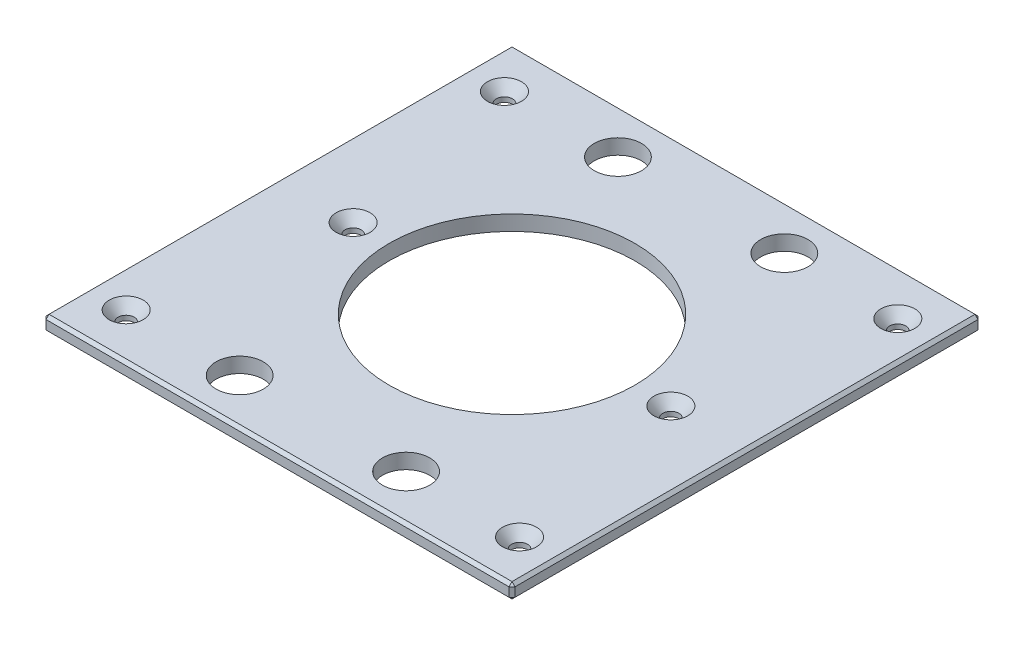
ISO-10303-21;
HEADER;
FILE_DESCRIPTION(('STEP AP214'),'2;1');
FILE_NAME('part.step','',(''),(''),'','','');
FILE_SCHEMA(('AUTOMOTIVE_DESIGN { 1 0 10303 214 1 1 1 1 }'));
ENDSEC;
DATA;
#1=APPLICATION_CONTEXT('core data for automotive mechanical design processes');
#2=APPLICATION_PROTOCOL_DEFINITION('international standard','automotive_design',2000,#1);
#3=PRODUCT_CONTEXT('',#1,'mechanical');
#4=PRODUCT('Part','Part','',(#3));
#5=PRODUCT_RELATED_PRODUCT_CATEGORY('part','',(#4));
#6=PRODUCT_DEFINITION_FORMATION('','',#4);
#7=PRODUCT_DEFINITION_CONTEXT('part definition',#1,'design');
#8=PRODUCT_DEFINITION('design','',#6,#7);
#9=PRODUCT_DEFINITION_SHAPE('','',#8);
#10=(LENGTH_UNIT() NAMED_UNIT(*) SI_UNIT(.MILLI.,.METRE.));
#11=(NAMED_UNIT(*) PLANE_ANGLE_UNIT() SI_UNIT($,.RADIAN.));
#12=(NAMED_UNIT(*) SI_UNIT($,.STERADIAN.) SOLID_ANGLE_UNIT());
#13=UNCERTAINTY_MEASURE_WITH_UNIT(LENGTH_MEASURE(1.E-05),#10,'distance_accuracy_value','');
#14=(GEOMETRIC_REPRESENTATION_CONTEXT(3) GLOBAL_UNCERTAINTY_ASSIGNED_CONTEXT((#13)) GLOBAL_UNIT_ASSIGNED_CONTEXT((#10,
#11,#12)) REPRESENTATION_CONTEXT('',''));
#15=CARTESIAN_POINT('',(0.,0.,0.));
#16=DIRECTION('',(0.,0.,1.));
#17=DIRECTION('',(1.,0.,0.));
#18=AXIS2_PLACEMENT_3D('',#15,#16,#17);
#19=CARTESIAN_POINT('',(-98.425,6.35,-98.425));
#20=DIRECTION('',(1.,0.,0.));
#21=DIRECTION('',(0.,0.,-1.));
#22=AXIS2_PLACEMENT_3D('',#19,#20,#21);
#23=PLANE('',#22);
#24=DIRECTION('',(0.,0.,-1.));
#25=VECTOR('',#24,1.);
#26=CARTESIAN_POINT('',(-98.425,5.08000000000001,-98.425));
#27=LINE('',#26,#25);
#28=CARTESIAN_POINT('',(-98.425,5.08000000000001,97.155));
#29=VERTEX_POINT('',#28);
#30=CARTESIAN_POINT('',(-98.425,5.08000000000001,-97.155));
#31=VERTEX_POINT('',#30);
#32=EDGE_CURVE('E134',#29,#31,#27,.T.);
#33=ORIENTED_EDGE('',*,*,#32,.T.);
#34=DIRECTION('',(0.,-1.,0.));
#35=VECTOR('',#34,1.);
#36=CARTESIAN_POINT('',(-98.425,6.35,-97.155));
#37=LINE('',#36,#35);
#38=CARTESIAN_POINT('',(-98.425,1.26999999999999,-97.155));
#39=VERTEX_POINT('',#38);
#40=EDGE_CURVE('E130',#31,#39,#37,.T.);
#41=ORIENTED_EDGE('',*,*,#40,.T.);
#42=DIRECTION('',(0.,0.,1.));
#43=VECTOR('',#42,1.);
#44=CARTESIAN_POINT('',(-98.425,1.26999999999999,-98.425));
#45=LINE('',#44,#43);
#46=CARTESIAN_POINT('',(-98.425,1.26999999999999,97.155));
#47=VERTEX_POINT('',#46);
#48=EDGE_CURVE('E125',#39,#47,#45,.T.);
#49=ORIENTED_EDGE('',*,*,#48,.T.);
#50=DIRECTION('',(0.,1.,0.));
#51=VECTOR('',#50,1.);
#52=CARTESIAN_POINT('',(-98.425,6.35,97.155));
#53=LINE('',#52,#51);
#54=EDGE_CURVE('E127',#47,#29,#53,.T.);
#55=ORIENTED_EDGE('',*,*,#54,.T.);
#56=EDGE_LOOP('',(#33,#41,#49,#55));
#57=FACE_BOUND('',#56,.T.);
#58=ADVANCED_FACE('F34',(#57),#23,.F.);
#59=CARTESIAN_POINT('',(-98.425,6.35,98.425));
#60=DIRECTION('',(0.,0.,-1.));
#61=DIRECTION('',(-1.,0.,0.));
#62=AXIS2_PLACEMENT_3D('',#59,#60,#61);
#63=PLANE('',#62);
#64=DIRECTION('',(1.,0.,0.));
#65=VECTOR('',#64,1.);
#66=CARTESIAN_POINT('',(-98.425,1.27000000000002,98.425));
#67=LINE('',#66,#65);
#68=CARTESIAN_POINT('',(-97.155,1.27000000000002,98.425));
#69=VERTEX_POINT('',#68);
#70=CARTESIAN_POINT('',(97.155,1.27000000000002,98.425));
#71=VERTEX_POINT('',#70);
#72=EDGE_CURVE('E57',#69,#71,#67,.T.);
#73=ORIENTED_EDGE('',*,*,#72,.T.);
#74=DIRECTION('',(0.,1.,0.));
#75=VECTOR('',#74,1.);
#76=CARTESIAN_POINT('',(97.155,6.35,98.425));
#77=LINE('',#76,#75);
#78=CARTESIAN_POINT('',(97.155,5.07999999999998,98.425));
#79=VERTEX_POINT('',#78);
#80=EDGE_CURVE('E11',#71,#79,#77,.T.);
#81=ORIENTED_EDGE('',*,*,#80,.T.);
#82=DIRECTION('',(-1.,0.,0.));
#83=VECTOR('',#82,1.);
#84=CARTESIAN_POINT('',(-98.425,5.07999999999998,98.425));
#85=LINE('',#84,#83);
#86=CARTESIAN_POINT('',(-97.155,5.07999999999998,98.425));
#87=VERTEX_POINT('',#86);
#88=EDGE_CURVE('E43',#79,#87,#85,.T.);
#89=ORIENTED_EDGE('',*,*,#88,.T.);
#90=DIRECTION('',(0.,-1.,0.));
#91=VECTOR('',#90,1.);
#92=CARTESIAN_POINT('',(-97.155,6.35,98.425));
#93=LINE('',#92,#91);
#94=EDGE_CURVE('E278',#87,#69,#93,.T.);
#95=ORIENTED_EDGE('',*,*,#94,.T.);
#96=EDGE_LOOP('',(#73,#81,#89,#95));
#97=FACE_BOUND('',#96,.T.);
#98=ADVANCED_FACE('F347',(#97),#63,.F.);
#99=CARTESIAN_POINT('',(98.425,6.35,-98.425));
#100=DIRECTION('',(-1.,0.,0.));
#101=DIRECTION('',(0.,0.,1.));
#102=AXIS2_PLACEMENT_3D('',#99,#100,#101);
#103=PLANE('',#102);
#104=DIRECTION('',(0.,0.,-1.));
#105=VECTOR('',#104,1.);
#106=CARTESIAN_POINT('',(98.425,1.27000000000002,-98.425));
#107=LINE('',#106,#105);
#108=CARTESIAN_POINT('',(98.425,1.27000000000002,97.155));
#109=VERTEX_POINT('',#108);
#110=CARTESIAN_POINT('',(98.425,1.27000000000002,-97.155));
#111=VERTEX_POINT('',#110);
#112=EDGE_CURVE('E273',#109,#111,#107,.T.);
#113=ORIENTED_EDGE('',*,*,#112,.T.);
#114=DIRECTION('',(0.,1.,0.));
#115=VECTOR('',#114,1.);
#116=CARTESIAN_POINT('',(98.425,6.35,-97.155));
#117=LINE('',#116,#115);
#118=CARTESIAN_POINT('',(98.425,5.08000000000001,-97.155));
#119=VERTEX_POINT('',#118);
#120=EDGE_CURVE('E275',#111,#119,#117,.T.);
#121=ORIENTED_EDGE('',*,*,#120,.T.);
#122=DIRECTION('',(0.,0.,1.));
#123=VECTOR('',#122,1.);
#124=CARTESIAN_POINT('',(98.425,5.08000000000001,98.425));
#125=LINE('',#124,#123);
#126=CARTESIAN_POINT('',(98.425,5.08000000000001,97.155));
#127=VERTEX_POINT('',#126);
#128=EDGE_CURVE('E271',#119,#127,#125,.T.);
#129=ORIENTED_EDGE('',*,*,#128,.T.);
#130=DIRECTION('',(0.,-1.,0.));
#131=VECTOR('',#130,1.);
#132=CARTESIAN_POINT('',(98.425,6.35,97.155));
#133=LINE('',#132,#131);
#134=EDGE_CURVE('E269',#127,#109,#133,.T.);
#135=ORIENTED_EDGE('',*,*,#134,.T.);
#136=EDGE_LOOP('',(#113,#121,#129,#135));
#137=FACE_BOUND('',#136,.T.);
#138=ADVANCED_FACE('F334',(#137),#103,.F.);
#139=CARTESIAN_POINT('',(-98.425,6.35,-98.425));
#140=DIRECTION('',(0.,0.,1.));
#141=DIRECTION('',(1.,0.,0.));
#142=AXIS2_PLACEMENT_3D('',#139,#140,#141);
#143=PLANE('',#142);
#144=DIRECTION('',(-1.,0.,0.));
#145=VECTOR('',#144,1.);
#146=CARTESIAN_POINT('',(-98.425,1.27000000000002,-98.425));
#147=LINE('',#146,#145);
#148=CARTESIAN_POINT('',(97.155,1.27000000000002,-98.425));
#149=VERTEX_POINT('',#148);
#150=CARTESIAN_POINT('',(-97.155,1.27000000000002,-98.425));
#151=VERTEX_POINT('',#150);
#152=EDGE_CURVE('E245',#149,#151,#147,.T.);
#153=ORIENTED_EDGE('',*,*,#152,.T.);
#154=DIRECTION('',(0.,1.,0.));
#155=VECTOR('',#154,1.);
#156=CARTESIAN_POINT('',(-97.155,6.35,-98.425));
#157=LINE('',#156,#155);
#158=CARTESIAN_POINT('',(-97.155,5.08000000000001,-98.425));
#159=VERTEX_POINT('',#158);
#160=EDGE_CURVE('E249',#151,#159,#157,.T.);
#161=ORIENTED_EDGE('',*,*,#160,.T.);
#162=DIRECTION('',(1.,0.,0.));
#163=VECTOR('',#162,1.);
#164=CARTESIAN_POINT('',(98.425,5.08000000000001,-98.425));
#165=LINE('',#164,#163);
#166=CARTESIAN_POINT('',(97.155,5.08000000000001,-98.425));
#167=VERTEX_POINT('',#166);
#168=EDGE_CURVE('E247',#159,#167,#165,.T.);
#169=ORIENTED_EDGE('',*,*,#168,.T.);
#170=DIRECTION('',(0.,-1.,0.));
#171=VECTOR('',#170,1.);
#172=CARTESIAN_POINT('',(97.155,6.35,-98.425));
#173=LINE('',#172,#171);
#174=EDGE_CURVE('E243',#167,#149,#173,.T.);
#175=ORIENTED_EDGE('',*,*,#174,.T.);
#176=EDGE_LOOP('',(#153,#161,#169,#175));
#177=FACE_BOUND('',#176,.T.);
#178=ADVANCED_FACE('F308',(#177),#143,.F.);
#179=CARTESIAN_POINT('',(0.,6.35,0.));
#180=DIRECTION('',(0.,1.,0.));
#181=DIRECTION('',(0.,0.,1.));
#182=AXIS2_PLACEMENT_3D('',#179,#180,#181);
#183=PLANE('',#182);
#184=CARTESIAN_POINT('',(82.55,6.35,-79.375));
#185=DIRECTION('',(0.,1.,0.));
#186=DIRECTION('',(0.,0.,1.));
#187=AXIS2_PLACEMENT_3D('',#184,#185,#186);
#188=CIRCLE('',#187,7.1374);
#189=CARTESIAN_POINT('',(82.55,6.35,-72.2376));
#190=VERTEX_POINT('',#189);
#191=EDGE_CURVE('E751',#190,#190,#188,.T.);
#192=ORIENTED_EDGE('',*,*,#191,.F.);
#193=EDGE_LOOP('',(#192));
#194=FACE_BOUND('',#193,.T.);
#195=CARTESIAN_POINT('',(82.55,6.35,79.375));
#196=DIRECTION('',(0.,1.,0.));
#197=DIRECTION('',(0.,0.,1.));
#198=AXIS2_PLACEMENT_3D('',#195,#196,#197);
#199=CIRCLE('',#198,7.1374);
#200=CARTESIAN_POINT('',(82.55,6.35,86.5124));
#201=VERTEX_POINT('',#200);
#202=EDGE_CURVE('E755',#201,#201,#199,.T.);
#203=ORIENTED_EDGE('',*,*,#202,.F.);
#204=EDGE_LOOP('',(#203));
#205=FACE_BOUND('',#204,.T.);
#206=CARTESIAN_POINT('',(-82.55,6.35,79.375));
#207=DIRECTION('',(0.,1.,0.));
#208=DIRECTION('',(0.,0.,1.));
#209=AXIS2_PLACEMENT_3D('',#206,#207,#208);
#210=CIRCLE('',#209,7.1374);
#211=CARTESIAN_POINT('',(-82.55,6.35,86.5124));
#212=VERTEX_POINT('',#211);
#213=EDGE_CURVE('E759',#212,#212,#210,.T.);
#214=ORIENTED_EDGE('',*,*,#213,.F.);
#215=EDGE_LOOP('',(#214));
#216=FACE_BOUND('',#215,.T.);
#217=CARTESIAN_POINT('',(-66.675,6.35,0.));
#218=DIRECTION('',(0.,1.,0.));
#219=DIRECTION('',(0.,0.,1.));
#220=AXIS2_PLACEMENT_3D('',#217,#218,#219);
#221=CIRCLE('',#220,7.1374);
#222=CARTESIAN_POINT('',(-66.675,6.35,7.1374));
#223=VERTEX_POINT('',#222);
#224=EDGE_CURVE('E763',#223,#223,#221,.T.);
#225=ORIENTED_EDGE('',*,*,#224,.F.);
#226=EDGE_LOOP('',(#225));
#227=FACE_BOUND('',#226,.T.);
#228=CARTESIAN_POINT('',(66.675,6.35,0.));
#229=DIRECTION('',(0.,1.,0.));
#230=DIRECTION('',(0.,0.,1.));
#231=AXIS2_PLACEMENT_3D('',#228,#229,#230);
#232=CIRCLE('',#231,7.1374);
#233=CARTESIAN_POINT('',(66.675,6.35,7.1374));
#234=VERTEX_POINT('',#233);
#235=EDGE_CURVE('E767',#234,#234,#232,.T.);
#236=ORIENTED_EDGE('',*,*,#235,.F.);
#237=EDGE_LOOP('',(#236));
#238=FACE_BOUND('',#237,.T.);
#239=CARTESIAN_POINT('',(-82.55,6.35,-79.375));
#240=DIRECTION('',(0.,1.,0.));
#241=DIRECTION('',(0.,0.,1.));
#242=AXIS2_PLACEMENT_3D('',#239,#240,#241);
#243=CIRCLE('',#242,7.1374);
#244=CARTESIAN_POINT('',(-82.55,6.35,-72.2376));
#245=VERTEX_POINT('',#244);
#246=EDGE_CURVE('E770',#245,#245,#243,.T.);
#247=ORIENTED_EDGE('',*,*,#246,.F.);
#248=EDGE_LOOP('',(#247));
#249=FACE_BOUND('',#248,.T.);
#250=DIRECTION('',(0.,0.,-1.));
#251=VECTOR('',#250,1.);
#252=CARTESIAN_POINT('',(97.155,6.35,-98.425));
#253=LINE('',#252,#251);
#254=CARTESIAN_POINT('',(97.155,6.35,97.155));
#255=VERTEX_POINT('',#254);
#256=CARTESIAN_POINT('',(97.155,6.35,-97.155));
#257=VERTEX_POINT('',#256);
#258=EDGE_CURVE('E256',#255,#257,#253,.T.);
#259=ORIENTED_EDGE('',*,*,#258,.T.);
#260=DIRECTION('',(-1.,0.,0.));
#261=VECTOR('',#260,1.);
#262=CARTESIAN_POINT('',(-98.425,6.35,-97.155));
#263=LINE('',#262,#261);
#264=CARTESIAN_POINT('',(-97.155,6.35,-97.155));
#265=VERTEX_POINT('',#264);
#266=EDGE_CURVE('E258',#257,#265,#263,.T.);
#267=ORIENTED_EDGE('',*,*,#266,.T.);
#268=DIRECTION('',(0.,0.,1.));
#269=VECTOR('',#268,1.);
#270=CARTESIAN_POINT('',(-97.155,6.35,98.425));
#271=LINE('',#270,#269);
#272=CARTESIAN_POINT('',(-97.155,6.35,97.155));
#273=VERTEX_POINT('',#272);
#274=EDGE_CURVE('E254',#265,#273,#271,.T.);
#275=ORIENTED_EDGE('',*,*,#274,.T.);
#276=DIRECTION('',(1.,0.,0.));
#277=VECTOR('',#276,1.);
#278=CARTESIAN_POINT('',(98.425,6.35,97.155));
#279=LINE('',#278,#277);
#280=EDGE_CURVE('E252',#273,#255,#279,.T.);
#281=ORIENTED_EDGE('',*,*,#280,.T.);
#282=EDGE_LOOP('',(#259,#267,#275,#281));
#283=FACE_BOUND('',#282,.T.);
#284=CARTESIAN_POINT('',(34.925,6.35,-79.375));
#285=DIRECTION('',(0.,1.,0.));
#286=DIRECTION('',(0.,0.,1.));
#287=AXIS2_PLACEMENT_3D('',#284,#285,#286);
#288=CIRCLE('',#287,9.921875);
#289=CARTESIAN_POINT('',(34.925,6.35,-69.453125));
#290=VERTEX_POINT('',#289);
#291=EDGE_CURVE('E203',#290,#290,#288,.T.);
#292=ORIENTED_EDGE('',*,*,#291,.F.);
#293=EDGE_LOOP('',(#292));
#294=FACE_BOUND('',#293,.T.);
#295=CARTESIAN_POINT('',(-34.925,6.35,-79.375));
#296=DIRECTION('',(0.,1.,0.));
#297=DIRECTION('',(0.,0.,1.));
#298=AXIS2_PLACEMENT_3D('',#295,#296,#297);
#299=CIRCLE('',#298,9.921875);
#300=CARTESIAN_POINT('',(-34.925,6.35,-69.453125));
#301=VERTEX_POINT('',#300);
#302=EDGE_CURVE('E213',#301,#301,#299,.T.);
#303=ORIENTED_EDGE('',*,*,#302,.F.);
#304=EDGE_LOOP('',(#303));
#305=FACE_BOUND('',#304,.T.);
#306=CARTESIAN_POINT('',(34.925,6.35,79.375));
#307=DIRECTION('',(0.,1.,0.));
#308=DIRECTION('',(0.,0.,1.));
#309=AXIS2_PLACEMENT_3D('',#306,#307,#308);
#310=CIRCLE('',#309,9.921875);
#311=CARTESIAN_POINT('',(34.925,6.35,89.296875));
#312=VERTEX_POINT('',#311);
#313=EDGE_CURVE('E224',#312,#312,#310,.T.);
#314=ORIENTED_EDGE('',*,*,#313,.F.);
#315=EDGE_LOOP('',(#314));
#316=FACE_BOUND('',#315,.T.);
#317=CARTESIAN_POINT('',(-34.925,6.35,79.375));
#318=DIRECTION('',(0.,1.,0.));
#319=DIRECTION('',(0.,0.,1.));
#320=AXIS2_PLACEMENT_3D('',#317,#318,#319);
#321=CIRCLE('',#320,9.921875);
#322=CARTESIAN_POINT('',(-34.925,6.35,89.296875));
#323=VERTEX_POINT('',#322);
#324=EDGE_CURVE('E230',#323,#323,#321,.T.);
#325=ORIENTED_EDGE('',*,*,#324,.F.);
#326=EDGE_LOOP('',(#325));
#327=FACE_BOUND('',#326,.T.);
#328=CARTESIAN_POINT('',(0.,6.35,0.));
#329=DIRECTION('',(0.,1.,0.));
#330=DIRECTION('',(0.,0.,1.));
#331=AXIS2_PLACEMENT_3D('',#328,#329,#330);
#332=CIRCLE('',#331,51.562);
#333=CARTESIAN_POINT('',(0.,6.35,51.562));
#334=VERTEX_POINT('',#333);
#335=EDGE_CURVE('E236',#334,#334,#332,.T.);
#336=ORIENTED_EDGE('',*,*,#335,.F.);
#337=EDGE_LOOP('',(#336));
#338=FACE_BOUND('',#337,.T.);
#339=ADVANCED_FACE('F356',(#194,#205,#216,#227,#238,#249,#283,#294,#305,#316,#327,#338),#183,.T.);
#340=CARTESIAN_POINT('',(0.,0.,0.));
#341=DIRECTION('',(0.,1.,0.));
#342=DIRECTION('',(0.,0.,1.));
#343=AXIS2_PLACEMENT_3D('',#340,#341,#342);
#344=PLANE('',#343);
#345=CARTESIAN_POINT('',(82.55,0.,-79.375));
#346=DIRECTION('',(0.,1.,0.));
#347=DIRECTION('',(0.,0.,1.));
#348=AXIS2_PLACEMENT_3D('',#345,#346,#347);
#349=CIRCLE('',#348,3.3782);
#350=CARTESIAN_POINT('',(82.55,0.,-75.9968));
#351=VERTEX_POINT('',#350);
#352=EDGE_CURVE('E804',#351,#351,#349,.T.);
#353=ORIENTED_EDGE('',*,*,#352,.T.);
#354=EDGE_LOOP('',(#353));
#355=FACE_BOUND('',#354,.T.);
#356=CARTESIAN_POINT('',(82.55,0.,79.375));
#357=DIRECTION('',(0.,1.,0.));
#358=DIRECTION('',(0.,0.,1.));
#359=AXIS2_PLACEMENT_3D('',#356,#357,#358);
#360=CIRCLE('',#359,3.3782);
#361=CARTESIAN_POINT('',(82.55,0.,82.7532));
#362=VERTEX_POINT('',#361);
#363=EDGE_CURVE('E797',#362,#362,#360,.T.);
#364=ORIENTED_EDGE('',*,*,#363,.T.);
#365=EDGE_LOOP('',(#364));
#366=FACE_BOUND('',#365,.T.);
#367=CARTESIAN_POINT('',(-82.55,0.,79.375));
#368=DIRECTION('',(0.,1.,0.));
#369=DIRECTION('',(0.,0.,1.));
#370=AXIS2_PLACEMENT_3D('',#367,#368,#369);
#371=CIRCLE('',#370,3.3782);
#372=CARTESIAN_POINT('',(-82.55,0.,82.7532));
#373=VERTEX_POINT('',#372);
#374=EDGE_CURVE('E790',#373,#373,#371,.T.);
#375=ORIENTED_EDGE('',*,*,#374,.T.);
#376=EDGE_LOOP('',(#375));
#377=FACE_BOUND('',#376,.T.);
#378=CARTESIAN_POINT('',(-66.675,0.,0.));
#379=DIRECTION('',(0.,1.,0.));
#380=DIRECTION('',(0.,0.,1.));
#381=AXIS2_PLACEMENT_3D('',#378,#379,#380);
#382=CIRCLE('',#381,3.3782);
#383=CARTESIAN_POINT('',(-66.675,0.,3.3782));
#384=VERTEX_POINT('',#383);
#385=EDGE_CURVE('E783',#384,#384,#382,.T.);
#386=ORIENTED_EDGE('',*,*,#385,.T.);
#387=EDGE_LOOP('',(#386));
#388=FACE_BOUND('',#387,.T.);
#389=CARTESIAN_POINT('',(66.675,0.,0.));
#390=DIRECTION('',(0.,1.,0.));
#391=DIRECTION('',(0.,0.,1.));
#392=AXIS2_PLACEMENT_3D('',#389,#390,#391);
#393=CIRCLE('',#392,3.3782);
#394=CARTESIAN_POINT('',(66.675,0.,3.3782));
#395=VERTEX_POINT('',#394);
#396=EDGE_CURVE('E773',#395,#395,#393,.T.);
#397=ORIENTED_EDGE('',*,*,#396,.T.);
#398=EDGE_LOOP('',(#397));
#399=FACE_BOUND('',#398,.T.);
#400=CARTESIAN_POINT('',(-82.55,0.,-79.375));
#401=DIRECTION('',(0.,1.,0.));
#402=DIRECTION('',(0.,0.,1.));
#403=AXIS2_PLACEMENT_3D('',#400,#401,#402);
#404=CIRCLE('',#403,3.3782);
#405=CARTESIAN_POINT('',(-82.55,0.,-75.9968));
#406=VERTEX_POINT('',#405);
#407=EDGE_CURVE('E216',#406,#406,#404,.T.);
#408=ORIENTED_EDGE('',*,*,#407,.T.);
#409=EDGE_LOOP('',(#408));
#410=FACE_BOUND('',#409,.T.);
#411=DIRECTION('',(0.,0.,-1.));
#412=VECTOR('',#411,1.);
#413=CARTESIAN_POINT('',(-97.155,0.,0.));
#414=LINE('',#413,#412);
#415=CARTESIAN_POINT('',(-97.155,0.,97.155));
#416=VERTEX_POINT('',#415);
#417=CARTESIAN_POINT('',(-97.155,0.,-97.155));
#418=VERTEX_POINT('',#417);
#419=EDGE_CURVE('E157',#416,#418,#414,.T.);
#420=ORIENTED_EDGE('',*,*,#419,.T.);
#421=DIRECTION('',(1.,0.,0.));
#422=VECTOR('',#421,1.);
#423=CARTESIAN_POINT('',(0.,0.,-97.155));
#424=LINE('',#423,#422);
#425=CARTESIAN_POINT('',(97.155,0.,-97.155));
#426=VERTEX_POINT('',#425);
#427=EDGE_CURVE('E266',#418,#426,#424,.T.);
#428=ORIENTED_EDGE('',*,*,#427,.T.);
#429=DIRECTION('',(0.,0.,1.));
#430=VECTOR('',#429,1.);
#431=CARTESIAN_POINT('',(97.155,0.,0.));
#432=LINE('',#431,#430);
#433=CARTESIAN_POINT('',(97.155,0.,97.155));
#434=VERTEX_POINT('',#433);
#435=EDGE_CURVE('E264',#426,#434,#432,.T.);
#436=ORIENTED_EDGE('',*,*,#435,.T.);
#437=DIRECTION('',(-1.,0.,0.));
#438=VECTOR('',#437,1.);
#439=CARTESIAN_POINT('',(0.,0.,97.155));
#440=LINE('',#439,#438);
#441=EDGE_CURVE('E261',#434,#416,#440,.T.);
#442=ORIENTED_EDGE('',*,*,#441,.T.);
#443=EDGE_LOOP('',(#420,#428,#436,#442));
#444=FACE_BOUND('',#443,.T.);
#445=CARTESIAN_POINT('',(34.925,0.,-79.375));
#446=DIRECTION('',(0.,1.,0.));
#447=DIRECTION('',(0.,0.,1.));
#448=AXIS2_PLACEMENT_3D('',#445,#446,#447);
#449=CIRCLE('',#448,9.921875);
#450=CARTESIAN_POINT('',(34.925,0.,-69.453125));
#451=VERTEX_POINT('',#450);
#452=EDGE_CURVE('E208',#451,#451,#449,.T.);
#453=ORIENTED_EDGE('',*,*,#452,.T.);
#454=EDGE_LOOP('',(#453));
#455=FACE_BOUND('',#454,.T.);
#456=CARTESIAN_POINT('',(-34.925,0.,-79.375));
#457=DIRECTION('',(0.,1.,0.));
#458=DIRECTION('',(0.,0.,1.));
#459=AXIS2_PLACEMENT_3D('',#456,#457,#458);
#460=CIRCLE('',#459,9.921875);
#461=CARTESIAN_POINT('',(-34.925,0.,-69.453125));
#462=VERTEX_POINT('',#461);
#463=EDGE_CURVE('E221',#462,#462,#460,.T.);
#464=ORIENTED_EDGE('',*,*,#463,.T.);
#465=EDGE_LOOP('',(#464));
#466=FACE_BOUND('',#465,.T.);
#467=CARTESIAN_POINT('',(34.925,0.,79.375));
#468=DIRECTION('',(0.,1.,0.));
#469=DIRECTION('',(0.,0.,1.));
#470=AXIS2_PLACEMENT_3D('',#467,#468,#469);
#471=CIRCLE('',#470,9.921875);
#472=CARTESIAN_POINT('',(34.925,0.,89.296875));
#473=VERTEX_POINT('',#472);
#474=EDGE_CURVE('E227',#473,#473,#471,.T.);
#475=ORIENTED_EDGE('',*,*,#474,.T.);
#476=EDGE_LOOP('',(#475));
#477=FACE_BOUND('',#476,.T.);
#478=CARTESIAN_POINT('',(-34.925,0.,79.375));
#479=DIRECTION('',(0.,1.,0.));
#480=DIRECTION('',(0.,0.,1.));
#481=AXIS2_PLACEMENT_3D('',#478,#479,#480);
#482=CIRCLE('',#481,9.921875);
#483=CARTESIAN_POINT('',(-34.925,0.,89.296875));
#484=VERTEX_POINT('',#483);
#485=EDGE_CURVE('E233',#484,#484,#482,.T.);
#486=ORIENTED_EDGE('',*,*,#485,.T.);
#487=EDGE_LOOP('',(#486));
#488=FACE_BOUND('',#487,.T.);
#489=CARTESIAN_POINT('',(0.,0.,0.));
#490=DIRECTION('',(0.,1.,0.));
#491=DIRECTION('',(0.,0.,1.));
#492=AXIS2_PLACEMENT_3D('',#489,#490,#491);
#493=CIRCLE('',#492,51.562);
#494=CARTESIAN_POINT('',(0.,0.,51.562));
#495=VERTEX_POINT('',#494);
#496=EDGE_CURVE('E146',#495,#495,#493,.T.);
#497=ORIENTED_EDGE('',*,*,#496,.T.);
#498=EDGE_LOOP('',(#497));
#499=FACE_BOUND('',#498,.T.);
#500=ADVANCED_FACE('F321',(#355,#366,#377,#388,#399,#410,#444,#455,#466,#477,#488,#499),#344,.F.);
#501=CARTESIAN_POINT('',(0.,0.,0.));
#502=DIRECTION('',(0.,1.,0.));
#503=DIRECTION('',(0.,0.,1.));
#504=AXIS2_PLACEMENT_3D('',#501,#502,#503);
#505=CYLINDRICAL_SURFACE('',#504,51.562);
#506=ORIENTED_EDGE('',*,*,#496,.F.);
#507=EDGE_LOOP('',(#506));
#508=FACE_BOUND('',#507,.T.);
#509=ORIENTED_EDGE('',*,*,#335,.T.);
#510=EDGE_LOOP('',(#509));
#511=FACE_BOUND('',#510,.T.);
#512=ADVANCED_FACE('F690',(#508,#511),#505,.F.);
#513=CARTESIAN_POINT('',(-34.925,6.35,79.375));
#514=DIRECTION('',(0.,1.,0.));
#515=DIRECTION('',(0.,0.,1.));
#516=AXIS2_PLACEMENT_3D('',#513,#514,#515);
#517=CYLINDRICAL_SURFACE('',#516,9.921875);
#518=ORIENTED_EDGE('',*,*,#485,.F.);
#519=EDGE_LOOP('',(#518));
#520=FACE_BOUND('',#519,.T.);
#521=ORIENTED_EDGE('',*,*,#324,.T.);
#522=EDGE_LOOP('',(#521));
#523=FACE_BOUND('',#522,.T.);
#524=ADVANCED_FACE('F681',(#520,#523),#517,.F.);
#525=CARTESIAN_POINT('',(34.925,6.35,79.375));
#526=DIRECTION('',(0.,1.,0.));
#527=DIRECTION('',(0.,0.,1.));
#528=AXIS2_PLACEMENT_3D('',#525,#526,#527);
#529=CYLINDRICAL_SURFACE('',#528,9.921875);
#530=ORIENTED_EDGE('',*,*,#474,.F.);
#531=EDGE_LOOP('',(#530));
#532=FACE_BOUND('',#531,.T.);
#533=ORIENTED_EDGE('',*,*,#313,.T.);
#534=EDGE_LOOP('',(#533));
#535=FACE_BOUND('',#534,.T.);
#536=ADVANCED_FACE('F672',(#532,#535),#529,.F.);
#537=CARTESIAN_POINT('',(-34.925,6.35,-79.375));
#538=DIRECTION('',(0.,1.,0.));
#539=DIRECTION('',(0.,0.,1.));
#540=AXIS2_PLACEMENT_3D('',#537,#538,#539);
#541=CYLINDRICAL_SURFACE('',#540,9.921875);
#542=ORIENTED_EDGE('',*,*,#463,.F.);
#543=EDGE_LOOP('',(#542));
#544=FACE_BOUND('',#543,.T.);
#545=ORIENTED_EDGE('',*,*,#302,.T.);
#546=EDGE_LOOP('',(#545));
#547=FACE_BOUND('',#546,.T.);
#548=ADVANCED_FACE('F662',(#544,#547),#541,.F.);
#549=CARTESIAN_POINT('',(34.925,6.35,-79.375));
#550=DIRECTION('',(0.,1.,0.));
#551=DIRECTION('',(0.,0.,1.));
#552=AXIS2_PLACEMENT_3D('',#549,#550,#551);
#553=CYLINDRICAL_SURFACE('',#552,9.921875);
#554=ORIENTED_EDGE('',*,*,#452,.F.);
#555=EDGE_LOOP('',(#554));
#556=FACE_BOUND('',#555,.T.);
#557=ORIENTED_EDGE('',*,*,#291,.T.);
#558=EDGE_LOOP('',(#557));
#559=FACE_BOUND('',#558,.T.);
#560=ADVANCED_FACE('F365',(#556,#559),#553,.F.);
#561=CARTESIAN_POINT('',(98.425,6.35,97.155));
#562=DIRECTION('',(-0.70710678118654,0.,-0.707106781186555));
#563=DIRECTION('',(0.,-1.,0.));
#564=AXIS2_PLACEMENT_3D('',#561,#562,#563);
#565=PLANE('',#564);
#566=DIRECTION('',(-0.707106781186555,0.,0.70710678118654));
#567=VECTOR('',#566,1.);
#568=CARTESIAN_POINT('',(98.425,5.08000000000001,97.155));
#569=LINE('',#568,#567);
#570=EDGE_CURVE('E38',#79,#127,#569,.F.);
#571=ORIENTED_EDGE('',*,*,#570,.F.);
#572=ORIENTED_EDGE('',*,*,#80,.F.);
#573=DIRECTION('',(0.707106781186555,0.,-0.70710678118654));
#574=VECTOR('',#573,1.);
#575=CARTESIAN_POINT('',(97.79,1.27000000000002,97.79));
#576=LINE('',#575,#574);
#577=EDGE_CURVE('E196',#109,#71,#576,.F.);
#578=ORIENTED_EDGE('',*,*,#577,.F.);
#579=ORIENTED_EDGE('',*,*,#134,.F.);
#580=EDGE_LOOP('',(#571,#572,#578,#579));
#581=FACE_BOUND('',#580,.T.);
#582=ADVANCED_FACE('F36',(#581),#565,.F.);
#583=CARTESIAN_POINT('',(98.425,5.08000000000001,97.155));
#584=DIRECTION('',(0.577350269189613,0.577350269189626,0.577350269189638));
#585=DIRECTION('',(0.,-0.707106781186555,0.70710678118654));
#586=AXIS2_PLACEMENT_3D('',#583,#584,#585);
#587=PLANE('',#586);
#588=DIRECTION('',(0.,-0.707106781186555,0.70710678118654));
#589=VECTOR('',#588,1.);
#590=CARTESIAN_POINT('',(97.155,5.71499999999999,97.79));
#591=LINE('',#590,#589);
#592=EDGE_CURVE('E192',#79,#255,#591,.F.);
#593=ORIENTED_EDGE('',*,*,#592,.F.);
#594=ORIENTED_EDGE('',*,*,#570,.T.);
#595=DIRECTION('',(-0.707106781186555,0.70710678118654,0.));
#596=VECTOR('',#595,1.);
#597=CARTESIAN_POINT('',(98.425,5.08000000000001,97.155));
#598=LINE('',#597,#596);
#599=EDGE_CURVE('E194',#255,#127,#598,.F.);
#600=ORIENTED_EDGE('',*,*,#599,.F.);
#601=EDGE_LOOP('',(#593,#594,#600));
#602=FACE_BOUND('',#601,.T.);
#603=ADVANCED_FACE('F358',(#602),#587,.T.);
#604=CARTESIAN_POINT('',(97.155,0.,97.155));
#605=DIRECTION('',(0.577350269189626,-0.577350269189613,0.577350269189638));
#606=DIRECTION('',(0.707106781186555,0.,-0.70710678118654));
#607=AXIS2_PLACEMENT_3D('',#604,#605,#606);
#608=PLANE('',#607);
#609=DIRECTION('',(-0.70710678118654,-0.707106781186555,0.));
#610=VECTOR('',#609,1.);
#611=CARTESIAN_POINT('',(97.155,0.,97.155));
#612=LINE('',#611,#610);
#613=EDGE_CURVE('E186',#109,#434,#612,.T.);
#614=ORIENTED_EDGE('',*,*,#613,.F.);
#615=ORIENTED_EDGE('',*,*,#577,.T.);
#616=DIRECTION('',(0.,0.707106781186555,0.70710678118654));
#617=VECTOR('',#616,1.);
#618=CARTESIAN_POINT('',(97.155,0.,97.155));
#619=LINE('',#618,#617);
#620=EDGE_CURVE('E189',#434,#71,#619,.T.);
#621=ORIENTED_EDGE('',*,*,#620,.F.);
#622=EDGE_LOOP('',(#614,#615,#621));
#623=FACE_BOUND('',#622,.T.);
#624=ADVANCED_FACE('F327',(#623),#608,.T.);
#625=CARTESIAN_POINT('',(97.155,6.35,0.));
#626=DIRECTION('',(0.70710678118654,0.707106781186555,0.));
#627=DIRECTION('',(0.,0.,1.));
#628=AXIS2_PLACEMENT_3D('',#625,#626,#627);
#629=PLANE('',#628);
#630=ORIENTED_EDGE('',*,*,#599,.T.);
#631=ORIENTED_EDGE('',*,*,#128,.F.);
#632=DIRECTION('',(0.707106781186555,-0.70710678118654,0.));
#633=VECTOR('',#632,1.);
#634=CARTESIAN_POINT('',(97.79,5.715,-97.155));
#635=LINE('',#634,#633);
#636=EDGE_CURVE('E181',#257,#119,#635,.T.);
#637=ORIENTED_EDGE('',*,*,#636,.F.);
#638=ORIENTED_EDGE('',*,*,#258,.F.);
#639=EDGE_LOOP('',(#630,#631,#637,#638));
#640=FACE_BOUND('',#639,.T.);
#641=ADVANCED_FACE('F344',(#640),#629,.T.);
#642=CARTESIAN_POINT('',(0.,6.35,97.155));
#643=DIRECTION('',(0.,0.70710678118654,0.707106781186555));
#644=DIRECTION('',(-1.,0.,0.));
#645=AXIS2_PLACEMENT_3D('',#642,#643,#644);
#646=PLANE('',#645);
#647=ORIENTED_EDGE('',*,*,#592,.T.);
#648=ORIENTED_EDGE('',*,*,#280,.F.);
#649=DIRECTION('',(0.,0.707106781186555,-0.70710678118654));
#650=VECTOR('',#649,1.);
#651=CARTESIAN_POINT('',(-97.155,6.35,97.155));
#652=LINE('',#651,#650);
#653=EDGE_CURVE('E178',#87,#273,#652,.T.);
#654=ORIENTED_EDGE('',*,*,#653,.F.);
#655=ORIENTED_EDGE('',*,*,#88,.F.);
#656=EDGE_LOOP('',(#647,#648,#654,#655));
#657=FACE_BOUND('',#656,.T.);
#658=ADVANCED_FACE('F349',(#657),#646,.T.);
#659=CARTESIAN_POINT('',(-97.155,6.35,98.425));
#660=DIRECTION('',(0.70710678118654,0.,-0.707106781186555));
#661=DIRECTION('',(0.,-1.,0.));
#662=AXIS2_PLACEMENT_3D('',#659,#660,#661);
#663=PLANE('',#662);
#664=DIRECTION('',(0.707106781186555,0.,0.70710678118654));
#665=VECTOR('',#664,1.);
#666=CARTESIAN_POINT('',(-98.425,1.26999999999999,97.155));
#667=LINE('',#666,#665);
#668=EDGE_CURVE('E141',#69,#47,#667,.F.);
#669=ORIENTED_EDGE('',*,*,#668,.F.);
#670=ORIENTED_EDGE('',*,*,#94,.F.);
#671=DIRECTION('',(-0.707106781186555,0.,-0.70710678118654));
#672=VECTOR('',#671,1.);
#673=CARTESIAN_POINT('',(-97.79,5.07999999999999,97.79));
#674=LINE('',#673,#672);
#675=EDGE_CURVE('E144',#29,#87,#674,.F.);
#676=ORIENTED_EDGE('',*,*,#675,.F.);
#677=ORIENTED_EDGE('',*,*,#54,.F.);
#678=EDGE_LOOP('',(#669,#670,#676,#677));
#679=FACE_BOUND('',#678,.T.);
#680=ADVANCED_FACE('F139',(#679),#663,.F.);
#681=CARTESIAN_POINT('',(-98.425,1.27000000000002,98.425));
#682=DIRECTION('',(0.,0.70710678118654,-0.707106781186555));
#683=DIRECTION('',(1.,0.,0.));
#684=AXIS2_PLACEMENT_3D('',#681,#682,#683);
#685=PLANE('',#684);
#686=ORIENTED_EDGE('',*,*,#620,.T.);
#687=ORIENTED_EDGE('',*,*,#72,.F.);
#688=DIRECTION('',(0.,-0.707106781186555,-0.70710678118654));
#689=VECTOR('',#688,1.);
#690=CARTESIAN_POINT('',(-97.155,0.635000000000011,97.79));
#691=LINE('',#690,#689);
#692=EDGE_CURVE('E154',#416,#69,#691,.F.);
#693=ORIENTED_EDGE('',*,*,#692,.F.);
#694=ORIENTED_EDGE('',*,*,#441,.F.);
#695=EDGE_LOOP('',(#686,#687,#693,#694));
#696=FACE_BOUND('',#695,.T.);
#697=ADVANCED_FACE('F326',(#696),#685,.F.);
#698=CARTESIAN_POINT('',(98.425,1.27000000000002,-98.425));
#699=DIRECTION('',(-0.707106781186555,0.70710678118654,0.));
#700=DIRECTION('',(0.,0.,-1.));
#701=AXIS2_PLACEMENT_3D('',#698,#699,#700);
#702=PLANE('',#701);
#703=ORIENTED_EDGE('',*,*,#613,.T.);
#704=ORIENTED_EDGE('',*,*,#435,.F.);
#705=DIRECTION('',(0.70710678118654,0.707106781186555,0.));
#706=VECTOR('',#705,1.);
#707=CARTESIAN_POINT('',(97.155,0.,-97.155));
#708=LINE('',#707,#706);
#709=EDGE_CURVE('E173',#111,#426,#708,.F.);
#710=ORIENTED_EDGE('',*,*,#709,.F.);
#711=ORIENTED_EDGE('',*,*,#112,.F.);
#712=EDGE_LOOP('',(#703,#704,#710,#711));
#713=FACE_BOUND('',#712,.T.);
#714=ADVANCED_FACE('F331',(#713),#702,.F.);
#715=CARTESIAN_POINT('',(97.155,6.35,-98.425));
#716=DIRECTION('',(-0.70710678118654,0.,0.707106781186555));
#717=DIRECTION('',(0.,-1.,0.));
#718=AXIS2_PLACEMENT_3D('',#715,#716,#717);
#719=PLANE('',#718);
#720=DIRECTION('',(0.707106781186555,0.,0.70710678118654));
#721=VECTOR('',#720,1.);
#722=CARTESIAN_POINT('',(97.155,5.08000000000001,-98.425));
#723=LINE('',#722,#721);
#724=EDGE_CURVE('E183',#119,#167,#723,.F.);
#725=ORIENTED_EDGE('',*,*,#724,.F.);
#726=ORIENTED_EDGE('',*,*,#120,.F.);
#727=DIRECTION('',(-0.707106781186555,0.,-0.70710678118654));
#728=VECTOR('',#727,1.);
#729=CARTESIAN_POINT('',(97.79,1.27000000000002,-97.79));
#730=LINE('',#729,#728);
#731=EDGE_CURVE('E170',#149,#111,#730,.F.);
#732=ORIENTED_EDGE('',*,*,#731,.F.);
#733=ORIENTED_EDGE('',*,*,#174,.F.);
#734=EDGE_LOOP('',(#725,#726,#732,#733));
#735=FACE_BOUND('',#734,.T.);
#736=ADVANCED_FACE('F339',(#735),#719,.F.);
#737=CARTESIAN_POINT('',(97.155,5.08000000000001,-98.425));
#738=DIRECTION('',(0.577350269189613,0.577350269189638,-0.577350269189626));
#739=DIRECTION('',(0.,0.70710678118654,0.707106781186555));
#740=AXIS2_PLACEMENT_3D('',#737,#738,#739);
#741=PLANE('',#740);
#742=ORIENTED_EDGE('',*,*,#636,.T.);
#743=ORIENTED_EDGE('',*,*,#724,.T.);
#744=DIRECTION('',(0.,0.70710678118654,0.707106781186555));
#745=VECTOR('',#744,1.);
#746=CARTESIAN_POINT('',(97.155,5.08000000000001,-98.425));
#747=LINE('',#746,#745);
#748=EDGE_CURVE('E162',#257,#167,#747,.F.);
#749=ORIENTED_EDGE('',*,*,#748,.F.);
#750=EDGE_LOOP('',(#742,#743,#749));
#751=FACE_BOUND('',#750,.T.);
#752=ADVANCED_FACE('F397',(#751),#741,.T.);
#753=CARTESIAN_POINT('',(-97.155,6.35,97.155));
#754=DIRECTION('',(-0.577350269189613,0.577350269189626,0.577350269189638));
#755=DIRECTION('',(0.,-0.707106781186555,0.70710678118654));
#756=AXIS2_PLACEMENT_3D('',#753,#754,#755);
#757=PLANE('',#756);
#758=ORIENTED_EDGE('',*,*,#675,.T.);
#759=ORIENTED_EDGE('',*,*,#653,.T.);
#760=DIRECTION('',(-0.707106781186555,-0.70710678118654,0.));
#761=VECTOR('',#760,1.);
#762=CARTESIAN_POINT('',(-97.155,6.35,97.155));
#763=LINE('',#762,#761);
#764=EDGE_CURVE('E158',#29,#273,#763,.F.);
#765=ORIENTED_EDGE('',*,*,#764,.F.);
#766=EDGE_LOOP('',(#758,#759,#765));
#767=FACE_BOUND('',#766,.T.);
#768=ADVANCED_FACE('F351',(#767),#757,.T.);
#769=CARTESIAN_POINT('',(-98.425,1.26999999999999,97.155));
#770=DIRECTION('',(-0.577350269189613,-0.577350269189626,0.577350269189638));
#771=DIRECTION('',(0.,-0.707106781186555,-0.70710678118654));
#772=AXIS2_PLACEMENT_3D('',#769,#770,#771);
#773=PLANE('',#772);
#774=ORIENTED_EDGE('',*,*,#692,.T.);
#775=ORIENTED_EDGE('',*,*,#668,.T.);
#776=DIRECTION('',(-0.707106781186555,0.70710678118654,0.));
#777=VECTOR('',#776,1.);
#778=CARTESIAN_POINT('',(-98.425,1.26999999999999,97.155));
#779=LINE('',#778,#777);
#780=EDGE_CURVE('E151',#416,#47,#779,.T.);
#781=ORIENTED_EDGE('',*,*,#780,.F.);
#782=EDGE_LOOP('',(#774,#775,#781));
#783=FACE_BOUND('',#782,.T.);
#784=ADVANCED_FACE('F150',(#783),#773,.T.);
#785=CARTESIAN_POINT('',(97.155,0.,-97.155));
#786=DIRECTION('',(0.577350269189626,-0.577350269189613,-0.577350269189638));
#787=DIRECTION('',(-0.707106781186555,0.,-0.70710678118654));
#788=AXIS2_PLACEMENT_3D('',#785,#786,#787);
#789=PLANE('',#788);
#790=ORIENTED_EDGE('',*,*,#731,.T.);
#791=ORIENTED_EDGE('',*,*,#709,.T.);
#792=DIRECTION('',(0.,-0.707106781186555,0.70710678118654));
#793=VECTOR('',#792,1.);
#794=CARTESIAN_POINT('',(97.155,0.,-97.155));
#795=LINE('',#794,#793);
#796=EDGE_CURVE('E159',#149,#426,#795,.T.);
#797=ORIENTED_EDGE('',*,*,#796,.F.);
#798=EDGE_LOOP('',(#790,#791,#797));
#799=FACE_BOUND('',#798,.T.);
#800=ADVANCED_FACE('F389',(#799),#789,.T.);
#801=CARTESIAN_POINT('',(0.,6.35,-97.155));
#802=DIRECTION('',(0.,0.707106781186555,-0.70710678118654));
#803=DIRECTION('',(1.,0.,0.));
#804=AXIS2_PLACEMENT_3D('',#801,#802,#803);
#805=PLANE('',#804);
#806=ORIENTED_EDGE('',*,*,#748,.T.);
#807=ORIENTED_EDGE('',*,*,#168,.F.);
#808=DIRECTION('',(0.,-0.70710678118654,-0.707106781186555));
#809=VECTOR('',#808,1.);
#810=CARTESIAN_POINT('',(-97.155,5.08000000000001,-98.425));
#811=LINE('',#810,#809);
#812=EDGE_CURVE('E164',#265,#159,#811,.T.);
#813=ORIENTED_EDGE('',*,*,#812,.F.);
#814=ORIENTED_EDGE('',*,*,#266,.F.);
#815=EDGE_LOOP('',(#806,#807,#813,#814));
#816=FACE_BOUND('',#815,.T.);
#817=ADVANCED_FACE('F303',(#816),#805,.T.);
#818=CARTESIAN_POINT('',(-97.155,6.35,0.));
#819=DIRECTION('',(-0.70710678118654,0.707106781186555,0.));
#820=DIRECTION('',(0.,0.,-1.));
#821=AXIS2_PLACEMENT_3D('',#818,#819,#820);
#822=PLANE('',#821);
#823=ORIENTED_EDGE('',*,*,#764,.T.);
#824=ORIENTED_EDGE('',*,*,#274,.F.);
#825=DIRECTION('',(0.707106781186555,0.70710678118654,0.));
#826=VECTOR('',#825,1.);
#827=CARTESIAN_POINT('',(-97.79,5.715,-97.155));
#828=LINE('',#827,#826);
#829=EDGE_CURVE('E292',#31,#265,#828,.T.);
#830=ORIENTED_EDGE('',*,*,#829,.F.);
#831=ORIENTED_EDGE('',*,*,#32,.F.);
#832=EDGE_LOOP('',(#823,#824,#830,#831));
#833=FACE_BOUND('',#832,.T.);
#834=ADVANCED_FACE('F354',(#833),#822,.T.);
#835=CARTESIAN_POINT('',(-98.425,1.26999999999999,-98.425));
#836=DIRECTION('',(0.70710678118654,0.707106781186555,0.));
#837=DIRECTION('',(0.,0.,1.));
#838=AXIS2_PLACEMENT_3D('',#835,#836,#837);
#839=PLANE('',#838);
#840=ORIENTED_EDGE('',*,*,#780,.T.);
#841=ORIENTED_EDGE('',*,*,#48,.F.);
#842=DIRECTION('',(0.707106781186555,-0.70710678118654,0.));
#843=VECTOR('',#842,1.);
#844=CARTESIAN_POINT('',(-98.425,1.26999999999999,-97.155));
#845=LINE('',#844,#843);
#846=EDGE_CURVE('E289',#418,#39,#845,.F.);
#847=ORIENTED_EDGE('',*,*,#846,.F.);
#848=ORIENTED_EDGE('',*,*,#419,.F.);
#849=EDGE_LOOP('',(#840,#841,#847,#848));
#850=FACE_BOUND('',#849,.T.);
#851=ADVANCED_FACE('F156',(#850),#839,.F.);
#852=CARTESIAN_POINT('',(-98.425,1.27000000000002,-98.425));
#853=DIRECTION('',(0.,0.70710678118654,0.707106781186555));
#854=DIRECTION('',(-1.,0.,0.));
#855=AXIS2_PLACEMENT_3D('',#852,#853,#854);
#856=PLANE('',#855);
#857=ORIENTED_EDGE('',*,*,#796,.T.);
#858=ORIENTED_EDGE('',*,*,#427,.F.);
#859=DIRECTION('',(0.,0.707106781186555,-0.70710678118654));
#860=VECTOR('',#859,1.);
#861=CARTESIAN_POINT('',(-97.155,0.635000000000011,-97.79));
#862=LINE('',#861,#860);
#863=EDGE_CURVE('E286',#151,#418,#862,.F.);
#864=ORIENTED_EDGE('',*,*,#863,.F.);
#865=ORIENTED_EDGE('',*,*,#152,.F.);
#866=EDGE_LOOP('',(#857,#858,#864,#865));
#867=FACE_BOUND('',#866,.T.);
#868=ADVANCED_FACE('F318',(#867),#856,.F.);
#869=CARTESIAN_POINT('',(-97.155,5.08000000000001,-98.425));
#870=DIRECTION('',(-0.577350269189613,0.577350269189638,-0.577350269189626));
#871=DIRECTION('',(0.,0.70710678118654,0.707106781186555));
#872=AXIS2_PLACEMENT_3D('',#869,#870,#871);
#873=PLANE('',#872);
#874=ORIENTED_EDGE('',*,*,#829,.T.);
#875=ORIENTED_EDGE('',*,*,#812,.T.);
#876=DIRECTION('',(0.707106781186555,0.,-0.70710678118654));
#877=VECTOR('',#876,1.);
#878=CARTESIAN_POINT('',(-97.155,5.08000000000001,-98.425));
#879=LINE('',#878,#877);
#880=EDGE_CURVE('E284',#31,#159,#879,.T.);
#881=ORIENTED_EDGE('',*,*,#880,.F.);
#882=EDGE_LOOP('',(#874,#875,#881));
#883=FACE_BOUND('',#882,.T.);
#884=ADVANCED_FACE('F298',(#883),#873,.T.);
#885=CARTESIAN_POINT('',(-98.425,1.26999999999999,-97.155));
#886=DIRECTION('',(-0.577350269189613,-0.577350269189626,-0.577350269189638));
#887=DIRECTION('',(0.,0.707106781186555,-0.70710678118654));
#888=AXIS2_PLACEMENT_3D('',#885,#886,#887);
#889=PLANE('',#888);
#890=ORIENTED_EDGE('',*,*,#863,.T.);
#891=ORIENTED_EDGE('',*,*,#846,.T.);
#892=DIRECTION('',(-0.707106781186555,0.,0.70710678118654));
#893=VECTOR('',#892,1.);
#894=CARTESIAN_POINT('',(-98.425,1.26999999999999,-97.155));
#895=LINE('',#894,#893);
#896=EDGE_CURVE('E282',#151,#39,#895,.T.);
#897=ORIENTED_EDGE('',*,*,#896,.F.);
#898=EDGE_LOOP('',(#890,#891,#897));
#899=FACE_BOUND('',#898,.T.);
#900=ADVANCED_FACE('F315',(#899),#889,.T.);
#901=CARTESIAN_POINT('',(-98.425,6.35,-97.155));
#902=DIRECTION('',(0.70710678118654,0.,0.707106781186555));
#903=DIRECTION('',(0.,-1.,0.));
#904=AXIS2_PLACEMENT_3D('',#901,#902,#903);
#905=PLANE('',#904);
#906=ORIENTED_EDGE('',*,*,#880,.T.);
#907=ORIENTED_EDGE('',*,*,#160,.F.);
#908=ORIENTED_EDGE('',*,*,#896,.T.);
#909=ORIENTED_EDGE('',*,*,#40,.F.);
#910=EDGE_LOOP('',(#906,#907,#908,#909));
#911=FACE_BOUND('',#910,.T.);
#912=ADVANCED_FACE('F313',(#911),#905,.F.);
#913=CARTESIAN_POINT('',(-82.55,6.35,-79.375));
#914=DIRECTION('',(0.,1.,0.));
#915=DIRECTION('',(0.,0.,1.));
#916=AXIS2_PLACEMENT_3D('',#913,#914,#915);
#917=CYLINDRICAL_SURFACE('',#916,3.3782);
#918=ORIENTED_EDGE('',*,*,#407,.F.);
#919=EDGE_LOOP('',(#918));
#920=FACE_BOUND('',#919,.T.);
#921=CARTESIAN_POINT('',(-82.55,2.02553508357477,-79.375));
#922=DIRECTION('',(0.,1.,0.));
#923=DIRECTION('',(0.,0.,1.));
#924=AXIS2_PLACEMENT_3D('',#921,#922,#923);
#925=CIRCLE('',#924,3.3782);
#926=CARTESIAN_POINT('',(-82.55,2.02553508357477,-75.9968));
#927=VERTEX_POINT('',#926);
#928=EDGE_CURVE('E772',#927,#927,#925,.T.);
#929=ORIENTED_EDGE('',*,*,#928,.T.);
#930=EDGE_LOOP('',(#929));
#931=FACE_BOUND('',#930,.T.);
#932=ADVANCED_FACE('F376',(#920,#931),#917,.F.);
#933=CARTESIAN_POINT('',(-82.55,6.35,-79.375));
#934=DIRECTION('',(0.,1.,0.));
#935=DIRECTION('',(0.,0.,1.));
#936=AXIS2_PLACEMENT_3D('',#933,#934,#935);
#937=CONICAL_SURFACE('',#936,7.1374,0.715584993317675);
#938=ORIENTED_EDGE('',*,*,#928,.F.);
#939=EDGE_LOOP('',(#938));
#940=FACE_BOUND('',#939,.T.);
#941=ORIENTED_EDGE('',*,*,#246,.T.);
#942=EDGE_LOOP('',(#941));
#943=FACE_BOUND('',#942,.T.);
#944=ADVANCED_FACE('F486',(#940,#943),#937,.F.);
#945=CARTESIAN_POINT('',(66.675,6.35,0.));
#946=DIRECTION('',(0.,1.,0.));
#947=DIRECTION('',(0.,0.,1.));
#948=AXIS2_PLACEMENT_3D('',#945,#946,#947);
#949=CYLINDRICAL_SURFACE('',#948,3.3782);
#950=ORIENTED_EDGE('',*,*,#396,.F.);
#951=EDGE_LOOP('',(#950));
#952=FACE_BOUND('',#951,.T.);
#953=CARTESIAN_POINT('',(66.675,2.02553508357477,0.));
#954=DIRECTION('',(0.,1.,0.));
#955=DIRECTION('',(0.,0.,1.));
#956=AXIS2_PLACEMENT_3D('',#953,#954,#955);
#957=CIRCLE('',#956,3.3782);
#958=CARTESIAN_POINT('',(66.675,2.02553508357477,3.3782));
#959=VERTEX_POINT('',#958);
#960=EDGE_CURVE('E777',#959,#959,#957,.T.);
#961=ORIENTED_EDGE('',*,*,#960,.T.);
#962=EDGE_LOOP('',(#961));
#963=FACE_BOUND('',#962,.T.);
#964=ADVANCED_FACE('F495',(#952,#963),#949,.F.);
#965=CARTESIAN_POINT('',(66.675,6.35,0.));
#966=DIRECTION('',(0.,1.,0.));
#967=DIRECTION('',(0.,0.,1.));
#968=AXIS2_PLACEMENT_3D('',#965,#966,#967);
#969=CONICAL_SURFACE('',#968,7.1374,0.715584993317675);
#970=ORIENTED_EDGE('',*,*,#960,.F.);
#971=EDGE_LOOP('',(#970));
#972=FACE_BOUND('',#971,.T.);
#973=ORIENTED_EDGE('',*,*,#235,.T.);
#974=EDGE_LOOP('',(#973));
#975=FACE_BOUND('',#974,.T.);
#976=ADVANCED_FACE('F503',(#972,#975),#969,.F.);
#977=CARTESIAN_POINT('',(-66.675,6.35,0.));
#978=DIRECTION('',(0.,1.,0.));
#979=DIRECTION('',(0.,0.,1.));
#980=AXIS2_PLACEMENT_3D('',#977,#978,#979);
#981=CYLINDRICAL_SURFACE('',#980,3.3782);
#982=ORIENTED_EDGE('',*,*,#385,.F.);
#983=EDGE_LOOP('',(#982));
#984=FACE_BOUND('',#983,.T.);
#985=CARTESIAN_POINT('',(-66.675,2.02553508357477,0.));
#986=DIRECTION('',(0.,1.,0.));
#987=DIRECTION('',(0.,0.,1.));
#988=AXIS2_PLACEMENT_3D('',#985,#986,#987);
#989=CIRCLE('',#988,3.3782);
#990=CARTESIAN_POINT('',(-66.675,2.02553508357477,3.3782));
#991=VERTEX_POINT('',#990);
#992=EDGE_CURVE('E786',#991,#991,#989,.T.);
#993=ORIENTED_EDGE('',*,*,#992,.T.);
#994=EDGE_LOOP('',(#993));
#995=FACE_BOUND('',#994,.T.);
#996=ADVANCED_FACE('F511',(#984,#995),#981,.F.);
#997=CARTESIAN_POINT('',(-66.675,6.35,0.));
#998=DIRECTION('',(0.,1.,0.));
#999=DIRECTION('',(0.,0.,1.));
#1000=AXIS2_PLACEMENT_3D('',#997,#998,#999);
#1001=CONICAL_SURFACE('',#1000,7.1374,0.715584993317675);
#1002=ORIENTED_EDGE('',*,*,#992,.F.);
#1003=EDGE_LOOP('',(#1002));
#1004=FACE_BOUND('',#1003,.T.);
#1005=ORIENTED_EDGE('',*,*,#224,.T.);
#1006=EDGE_LOOP('',(#1005));
#1007=FACE_BOUND('',#1006,.T.);
#1008=ADVANCED_FACE('F519',(#1004,#1007),#1001,.F.);
#1009=CARTESIAN_POINT('',(-82.55,6.35,79.375));
#1010=DIRECTION('',(0.,1.,0.));
#1011=DIRECTION('',(0.,0.,1.));
#1012=AXIS2_PLACEMENT_3D('',#1009,#1010,#1011);
#1013=CYLINDRICAL_SURFACE('',#1012,3.3782);
#1014=ORIENTED_EDGE('',*,*,#374,.F.);
#1015=EDGE_LOOP('',(#1014));
#1016=FACE_BOUND('',#1015,.T.);
#1017=CARTESIAN_POINT('',(-82.55,2.02553508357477,79.375));
#1018=DIRECTION('',(0.,1.,0.));
#1019=DIRECTION('',(0.,0.,1.));
#1020=AXIS2_PLACEMENT_3D('',#1017,#1018,#1019);
#1021=CIRCLE('',#1020,3.3782);
#1022=CARTESIAN_POINT('',(-82.55,2.02553508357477,82.7532));
#1023=VERTEX_POINT('',#1022);
#1024=EDGE_CURVE('E793',#1023,#1023,#1021,.T.);
#1025=ORIENTED_EDGE('',*,*,#1024,.T.);
#1026=EDGE_LOOP('',(#1025));
#1027=FACE_BOUND('',#1026,.T.);
#1028=ADVANCED_FACE('F527',(#1016,#1027),#1013,.F.);
#1029=CARTESIAN_POINT('',(-82.55,6.35,79.375));
#1030=DIRECTION('',(0.,1.,0.));
#1031=DIRECTION('',(0.,0.,1.));
#1032=AXIS2_PLACEMENT_3D('',#1029,#1030,#1031);
#1033=CONICAL_SURFACE('',#1032,7.1374,0.715584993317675);
#1034=ORIENTED_EDGE('',*,*,#1024,.F.);
#1035=EDGE_LOOP('',(#1034));
#1036=FACE_BOUND('',#1035,.T.);
#1037=ORIENTED_EDGE('',*,*,#213,.T.);
#1038=EDGE_LOOP('',(#1037));
#1039=FACE_BOUND('',#1038,.T.);
#1040=ADVANCED_FACE('F535',(#1036,#1039),#1033,.F.);
#1041=CARTESIAN_POINT('',(82.55,6.35,79.375));
#1042=DIRECTION('',(0.,1.,0.));
#1043=DIRECTION('',(0.,0.,1.));
#1044=AXIS2_PLACEMENT_3D('',#1041,#1042,#1043);
#1045=CYLINDRICAL_SURFACE('',#1044,3.3782);
#1046=ORIENTED_EDGE('',*,*,#363,.F.);
#1047=EDGE_LOOP('',(#1046));
#1048=FACE_BOUND('',#1047,.T.);
#1049=CARTESIAN_POINT('',(82.55,2.02553508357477,79.375));
#1050=DIRECTION('',(0.,1.,0.));
#1051=DIRECTION('',(0.,0.,1.));
#1052=AXIS2_PLACEMENT_3D('',#1049,#1050,#1051);
#1053=CIRCLE('',#1052,3.3782);
#1054=CARTESIAN_POINT('',(82.55,2.02553508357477,82.7532));
#1055=VERTEX_POINT('',#1054);
#1056=EDGE_CURVE('E800',#1055,#1055,#1053,.T.);
#1057=ORIENTED_EDGE('',*,*,#1056,.T.);
#1058=EDGE_LOOP('',(#1057));
#1059=FACE_BOUND('',#1058,.T.);
#1060=ADVANCED_FACE('F543',(#1048,#1059),#1045,.F.);
#1061=CARTESIAN_POINT('',(82.55,6.35,79.375));
#1062=DIRECTION('',(0.,1.,0.));
#1063=DIRECTION('',(0.,0.,1.));
#1064=AXIS2_PLACEMENT_3D('',#1061,#1062,#1063);
#1065=CONICAL_SURFACE('',#1064,7.1374,0.715584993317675);
#1066=ORIENTED_EDGE('',*,*,#1056,.F.);
#1067=EDGE_LOOP('',(#1066));
#1068=FACE_BOUND('',#1067,.T.);
#1069=ORIENTED_EDGE('',*,*,#202,.T.);
#1070=EDGE_LOOP('',(#1069));
#1071=FACE_BOUND('',#1070,.T.);
#1072=ADVANCED_FACE('F551',(#1068,#1071),#1065,.F.);
#1073=CARTESIAN_POINT('',(82.55,6.35,-79.375));
#1074=DIRECTION('',(0.,1.,0.));
#1075=DIRECTION('',(0.,0.,1.));
#1076=AXIS2_PLACEMENT_3D('',#1073,#1074,#1075);
#1077=CYLINDRICAL_SURFACE('',#1076,3.3782);
#1078=ORIENTED_EDGE('',*,*,#352,.F.);
#1079=EDGE_LOOP('',(#1078));
#1080=FACE_BOUND('',#1079,.T.);
#1081=CARTESIAN_POINT('',(82.55,2.02553508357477,-79.375));
#1082=DIRECTION('',(0.,1.,0.));
#1083=DIRECTION('',(0.,0.,1.));
#1084=AXIS2_PLACEMENT_3D('',#1081,#1082,#1083);
#1085=CIRCLE('',#1084,3.3782);
#1086=CARTESIAN_POINT('',(82.55,2.02553508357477,-75.9968));
#1087=VERTEX_POINT('',#1086);
#1088=EDGE_CURVE('E807',#1087,#1087,#1085,.T.);
#1089=ORIENTED_EDGE('',*,*,#1088,.T.);
#1090=EDGE_LOOP('',(#1089));
#1091=FACE_BOUND('',#1090,.T.);
#1092=ADVANCED_FACE('F559',(#1080,#1091),#1077,.F.);
#1093=CARTESIAN_POINT('',(82.55,6.35,-79.375));
#1094=DIRECTION('',(0.,1.,0.));
#1095=DIRECTION('',(0.,0.,1.));
#1096=AXIS2_PLACEMENT_3D('',#1093,#1094,#1095);
#1097=CONICAL_SURFACE('',#1096,7.1374,0.715584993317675);
#1098=ORIENTED_EDGE('',*,*,#1088,.F.);
#1099=EDGE_LOOP('',(#1098));
#1100=FACE_BOUND('',#1099,.T.);
#1101=ORIENTED_EDGE('',*,*,#191,.T.);
#1102=EDGE_LOOP('',(#1101));
#1103=FACE_BOUND('',#1102,.T.);
#1104=ADVANCED_FACE('F567',(#1100,#1103),#1097,.F.);
#1105=CLOSED_SHELL('',(#58,#98,#138,#178,#339,#500,#512,#524,#536,#548,#560,#582,#603,#624,#641,
#658,#680,#697,#714,#736,#752,#768,#784,#800,#817,#834,#851,#868,#884,#900,#912,#932,#944,#964,
#976,#996,#1008,#1028,#1040,#1060,#1072,#1092,#1104));
#1106=MANIFOLD_SOLID_BREP('B2',#1105);
#1107=ADVANCED_BREP_SHAPE_REPRESENTATION('',(#18,#1106),#14);
#1108=SHAPE_DEFINITION_REPRESENTATION(#9,#1107);
ENDSEC;
END-ISO-10303-21;
